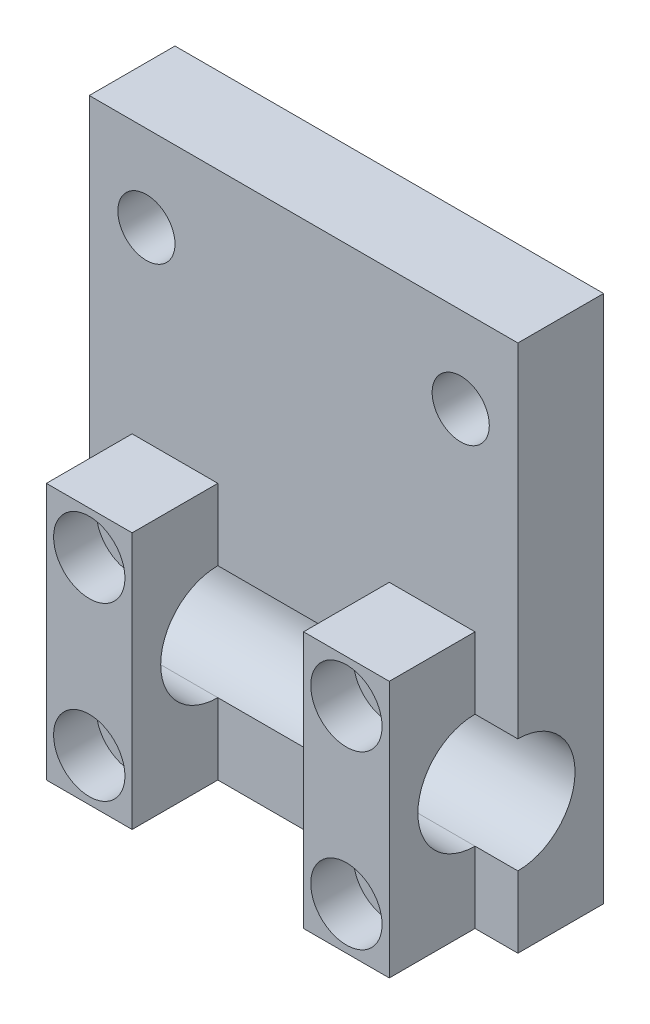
from build123d import *

# Parameters (mm, degrees)
SKETCH2_W             = 47.625
SKETCH2_H             = 58.7248
SKETCH2_R             = 2.3876
SKETCH2_R_2           = 3.175
BOSS_EXTRUDE1_DEPTH   = 9.525
SKETCH3_W             = 9.525
SKETCH3_H             = 28.5496
SKETCH3_R             = 2.3876
BOSS_EXTRUDE2_DEPTH   = 9.525
BOSS_EXTRUDE2_2_DEPTH = 9.525
CUT_EXTRUDE1_START    = 4.7752
SKETCH4_R             = 3.9624
CUT_EXTRUDE1_DEPTH    = 9.525
SKETCH5_R             = 6.35
CUT_EXTRUDE2_DEPTH    = 38.1


with BuildPart() as part:
    # Sketch2 → Boss-Extrude1 (new body)
    with BuildSketch(Plane.XY):
        with Locations((0, 15.0876)):
            Rectangle(SKETCH2_W, SKETCH2_H)
        with Locations((-14.2875, -9.525)):
            Circle(SKETCH2_R, mode=Mode.SUBTRACT)
        with Locations((14.2875, -9.525)):
            Circle(SKETCH2_R, mode=Mode.SUBTRACT)
        with Locations((14.2875, 9.525)):
            Circle(SKETCH2_R, mode=Mode.SUBTRACT)
        with Locations((-14.2875, 9.525)):
            Circle(SKETCH2_R, mode=Mode.SUBTRACT)
        with Locations((17.4625, 34.925)):
            Circle(SKETCH2_R_2, mode=Mode.SUBTRACT)
        with Locations((-17.4625, 34.925)):
            Circle(SKETCH2_R_2, mode=Mode.SUBTRACT)
    extrude(amount=-BOSS_EXTRUDE1_DEPTH)


with BuildPart() as body_2:
    # Sketch3 → Boss-Extrude2 (new body)
    with BuildSketch(Plane.XY):
        with Locations((-14.2875, 0)):
            Rectangle(SKETCH3_W, SKETCH3_H)
        with Locations(Location((-14.2875, 9.525, 0), (0, 0, 180))):
            Circle(SKETCH3_R, mode=Mode.SUBTRACT)
        with Locations(Location((-14.2875, -9.525, 0), (0, 0, 180))):
            Circle(SKETCH3_R, mode=Mode.SUBTRACT)
    extrude(amount=BOSS_EXTRUDE2_DEPTH)


with BuildPart() as body_3:
    # Sketch3 → Boss-Extrude2 2 (new body)
    with BuildSketch(Plane.XY):
        with Locations((14.2875, 0)):
            Rectangle(SKETCH3_W, SKETCH3_H)
        with Locations(Location((14.2875, -9.525, 0), (0, 0, 180))):
            Circle(SKETCH3_R, mode=Mode.SUBTRACT)
        with Locations(Location((14.2875, 9.525, 0), (0, 0, 180))):
            Circle(SKETCH3_R, mode=Mode.SUBTRACT)
    extrude(amount=BOSS_EXTRUDE2_2_DEPTH)


with BuildPart() as cut_extrude1_tool:
    # Sketch4 → Cut-Extrude1 (new body)
    with BuildSketch(Plane.XY.offset(CUT_EXTRUDE1_START)):
        with Locations(Location((-14.2875, 9.525, 0), (0, 0, 180))):
            Circle(SKETCH4_R)
        with Locations(Location((-14.2875, -9.525, 0), (0, 0, 180))):
            Circle(SKETCH4_R)
        with Locations(Location((14.2875, -9.525, 0), (0, 0, 180))):
            Circle(SKETCH4_R)
        with Locations(Location((14.2875, 9.525, 0), (0, 0, 180))):
            Circle(SKETCH4_R)
    extrude(amount=CUT_EXTRUDE1_DEPTH)


with BuildPart() as body_2_1:
    add(body_2.part)

    # Cut-Extrude1: cut by cut_extrude1_tool
    add(cut_extrude1_tool.part, mode=Mode.SUBTRACT)


with BuildPart() as body_3_1:
    add(body_3.part)

    # Cut-Extrude1: cut by cut_extrude1_tool
    add(cut_extrude1_tool.part, mode=Mode.SUBTRACT)


with BuildPart() as cut_extrude2_tool:
    # Sketch5 → Cut-Extrude2 (new, symmetric)
    with BuildSketch(Plane(origin=(0, 0, 0), x_dir=(0, 0, -1), z_dir=(1, 0, 0))):
        Circle(SKETCH5_R)
    extrude(amount=CUT_EXTRUDE2_DEPTH, both=True)


with BuildPart() as part_1:
    add(part.part)

    # Cut-Extrude2: cut by cut_extrude2_tool
    add(cut_extrude2_tool.part, mode=Mode.SUBTRACT)


with BuildPart() as body_2_2:
    add(body_2_1.part)

    # Cut-Extrude2: cut by cut_extrude2_tool
    add(cut_extrude2_tool.part, mode=Mode.SUBTRACT)


with BuildPart() as body_3_2:
    add(body_3_1.part)

    # Cut-Extrude2: cut by cut_extrude2_tool
    add(cut_extrude2_tool.part, mode=Mode.SUBTRACT)


solid = Compound([part_1.part, body_2_2.part, body_3_2.part])
